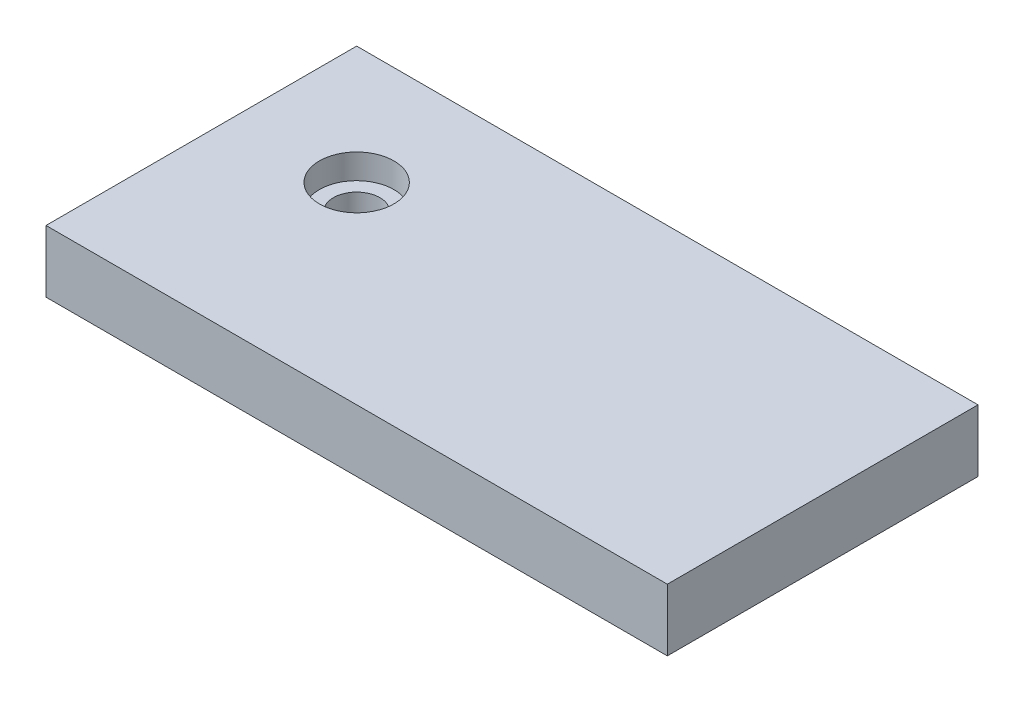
ISO-10303-21;
HEADER;
FILE_DESCRIPTION(('STEP AP214'),'2;1');
FILE_NAME('part.step','',(''),(''),'','','');
FILE_SCHEMA(('AUTOMOTIVE_DESIGN { 1 0 10303 214 1 1 1 1 }'));
ENDSEC;
DATA;
#1=APPLICATION_CONTEXT('core data for automotive mechanical design processes');
#2=APPLICATION_PROTOCOL_DEFINITION('international standard','automotive_design',2000,#1);
#3=PRODUCT_CONTEXT('',#1,'mechanical');
#4=PRODUCT('Part','Part','',(#3));
#5=PRODUCT_RELATED_PRODUCT_CATEGORY('part','',(#4));
#6=PRODUCT_DEFINITION_FORMATION('','',#4);
#7=PRODUCT_DEFINITION_CONTEXT('part definition',#1,'design');
#8=PRODUCT_DEFINITION('design','',#6,#7);
#9=PRODUCT_DEFINITION_SHAPE('','',#8);
#10=(LENGTH_UNIT() NAMED_UNIT(*) SI_UNIT(.MILLI.,.METRE.));
#11=(NAMED_UNIT(*) PLANE_ANGLE_UNIT() SI_UNIT($,.RADIAN.));
#12=(NAMED_UNIT(*) SI_UNIT($,.STERADIAN.) SOLID_ANGLE_UNIT());
#13=UNCERTAINTY_MEASURE_WITH_UNIT(LENGTH_MEASURE(1.E-05),#10,'distance_accuracy_value','');
#14=(GEOMETRIC_REPRESENTATION_CONTEXT(3) GLOBAL_UNCERTAINTY_ASSIGNED_CONTEXT((#13)) GLOBAL_UNIT_ASSIGNED_CONTEXT((#10,
#11,#12)) REPRESENTATION_CONTEXT('',''));
#15=CARTESIAN_POINT('',(0.,0.,0.));
#16=DIRECTION('',(0.,0.,1.));
#17=DIRECTION('',(1.,0.,0.));
#18=AXIS2_PLACEMENT_3D('',#15,#16,#17);
#19=CARTESIAN_POINT('',(0.,10.,0.));
#20=DIRECTION('',(1.,0.,0.));
#21=DIRECTION('',(0.,0.,-1.));
#22=AXIS2_PLACEMENT_3D('',#19,#20,#21);
#23=PLANE('',#22);
#24=DIRECTION('',(0.,0.,1.));
#25=VECTOR('',#24,1.);
#26=CARTESIAN_POINT('',(0.,0.,0.));
#27=LINE('',#26,#25);
#28=CARTESIAN_POINT('',(0.,0.,-50.));
#29=VERTEX_POINT('',#28);
#30=CARTESIAN_POINT('',(0.,0.,0.));
#31=VERTEX_POINT('',#30);
#32=EDGE_CURVE('E95',#29,#31,#27,.T.);
#33=ORIENTED_EDGE('',*,*,#32,.T.);
#34=DIRECTION('',(0.,-1.,0.));
#35=VECTOR('',#34,1.);
#36=CARTESIAN_POINT('',(0.,10.,0.));
#37=LINE('',#36,#35);
#38=CARTESIAN_POINT('',(0.,10.,0.));
#39=VERTEX_POINT('',#38);
#40=EDGE_CURVE('E11',#39,#31,#37,.T.);
#41=ORIENTED_EDGE('',*,*,#40,.F.);
#42=DIRECTION('',(0.,0.,1.));
#43=VECTOR('',#42,1.);
#44=CARTESIAN_POINT('',(0.,10.,0.));
#45=LINE('',#44,#43);
#46=CARTESIAN_POINT('',(0.,10.,-50.));
#47=VERTEX_POINT('',#46);
#48=EDGE_CURVE('E83',#47,#39,#45,.T.);
#49=ORIENTED_EDGE('',*,*,#48,.F.);
#50=DIRECTION('',(0.,-1.,0.));
#51=VECTOR('',#50,1.);
#52=CARTESIAN_POINT('',(0.,10.,-50.));
#53=LINE('',#52,#51);
#54=EDGE_CURVE('E91',#47,#29,#53,.T.);
#55=ORIENTED_EDGE('',*,*,#54,.T.);
#56=EDGE_LOOP('',(#33,#41,#49,#55));
#57=FACE_BOUND('',#56,.T.);
#58=ADVANCED_FACE('F32',(#57),#23,.F.);
#59=CARTESIAN_POINT('',(0.,10.,0.));
#60=DIRECTION('',(0.,0.,-1.));
#61=DIRECTION('',(-1.,0.,0.));
#62=AXIS2_PLACEMENT_3D('',#59,#60,#61);
#63=PLANE('',#62);
#64=DIRECTION('',(1.,0.,0.));
#65=VECTOR('',#64,1.);
#66=CARTESIAN_POINT('',(0.,0.,0.));
#67=LINE('',#66,#65);
#68=CARTESIAN_POINT('',(100.,0.,0.));
#69=VERTEX_POINT('',#68);
#70=EDGE_CURVE('E87',#31,#69,#67,.T.);
#71=ORIENTED_EDGE('',*,*,#70,.T.);
#72=DIRECTION('',(0.,-1.,0.));
#73=VECTOR('',#72,1.);
#74=CARTESIAN_POINT('',(100.,10.,0.));
#75=LINE('',#74,#73);
#76=CARTESIAN_POINT('',(100.,10.,0.));
#77=VERTEX_POINT('',#76);
#78=EDGE_CURVE('E40',#77,#69,#75,.T.);
#79=ORIENTED_EDGE('',*,*,#78,.F.);
#80=DIRECTION('',(1.,0.,0.));
#81=VECTOR('',#80,1.);
#82=CARTESIAN_POINT('',(0.,10.,0.));
#83=LINE('',#82,#81);
#84=EDGE_CURVE('E78',#39,#77,#83,.T.);
#85=ORIENTED_EDGE('',*,*,#84,.F.);
#86=ORIENTED_EDGE('',*,*,#40,.T.);
#87=EDGE_LOOP('',(#71,#79,#85,#86));
#88=FACE_BOUND('',#87,.T.);
#89=ADVANCED_FACE('F86',(#88),#63,.F.);
#90=CARTESIAN_POINT('',(100.,10.,0.));
#91=DIRECTION('',(-1.,0.,0.));
#92=DIRECTION('',(0.,0.,1.));
#93=AXIS2_PLACEMENT_3D('',#90,#91,#92);
#94=PLANE('',#93);
#95=DIRECTION('',(0.,0.,-1.));
#96=VECTOR('',#95,1.);
#97=CARTESIAN_POINT('',(100.,0.,0.));
#98=LINE('',#97,#96);
#99=CARTESIAN_POINT('',(100.,0.,-50.));
#100=VERTEX_POINT('',#99);
#101=EDGE_CURVE('E65',#69,#100,#98,.T.);
#102=ORIENTED_EDGE('',*,*,#101,.T.);
#103=DIRECTION('',(0.,-1.,0.));
#104=VECTOR('',#103,1.);
#105=CARTESIAN_POINT('',(100.,10.,-50.));
#106=LINE('',#105,#104);
#107=CARTESIAN_POINT('',(100.,10.,-50.));
#108=VERTEX_POINT('',#107);
#109=EDGE_CURVE('E88',#108,#100,#106,.T.);
#110=ORIENTED_EDGE('',*,*,#109,.F.);
#111=DIRECTION('',(0.,0.,-1.));
#112=VECTOR('',#111,1.);
#113=CARTESIAN_POINT('',(100.,10.,0.));
#114=LINE('',#113,#112);
#115=EDGE_CURVE('E81',#77,#108,#114,.T.);
#116=ORIENTED_EDGE('',*,*,#115,.F.);
#117=ORIENTED_EDGE('',*,*,#78,.T.);
#118=EDGE_LOOP('',(#102,#110,#116,#117));
#119=FACE_BOUND('',#118,.T.);
#120=ADVANCED_FACE('F89',(#119),#94,.F.);
#121=CARTESIAN_POINT('',(0.,10.,-50.));
#122=DIRECTION('',(0.,0.,1.));
#123=DIRECTION('',(1.,0.,0.));
#124=AXIS2_PLACEMENT_3D('',#121,#122,#123);
#125=PLANE('',#124);
#126=DIRECTION('',(-1.,0.,0.));
#127=VECTOR('',#126,1.);
#128=CARTESIAN_POINT('',(0.,0.,-50.));
#129=LINE('',#128,#127);
#130=EDGE_CURVE('E71',#100,#29,#129,.T.);
#131=ORIENTED_EDGE('',*,*,#130,.T.);
#132=ORIENTED_EDGE('',*,*,#54,.F.);
#133=DIRECTION('',(-1.,0.,0.));
#134=VECTOR('',#133,1.);
#135=CARTESIAN_POINT('',(0.,10.,-50.));
#136=LINE('',#135,#134);
#137=EDGE_CURVE('E48',#108,#47,#136,.T.);
#138=ORIENTED_EDGE('',*,*,#137,.F.);
#139=ORIENTED_EDGE('',*,*,#109,.T.);
#140=EDGE_LOOP('',(#131,#132,#138,#139));
#141=FACE_BOUND('',#140,.T.);
#142=ADVANCED_FACE('F103',(#141),#125,.F.);
#143=CARTESIAN_POINT('',(0.,10.,-50.));
#144=DIRECTION('',(0.,-1.,0.));
#145=DIRECTION('',(0.,0.,-1.));
#146=AXIS2_PLACEMENT_3D('',#143,#144,#145);
#147=PLANE('',#146);
#148=CARTESIAN_POINT('',(19.,10.,-31.));
#149=DIRECTION('',(0.,1.,0.));
#150=DIRECTION('',(0.,0.,1.));
#151=AXIS2_PLACEMENT_3D('',#148,#149,#150);
#152=CIRCLE('',#151,6.);
#153=CARTESIAN_POINT('',(19.,10.,-25.));
#154=VERTEX_POINT('',#153);
#155=EDGE_CURVE('E117',#154,#154,#152,.T.);
#156=ORIENTED_EDGE('',*,*,#155,.F.);
#157=EDGE_LOOP('',(#156));
#158=FACE_BOUND('',#157,.T.);
#159=ORIENTED_EDGE('',*,*,#48,.T.);
#160=ORIENTED_EDGE('',*,*,#84,.T.);
#161=ORIENTED_EDGE('',*,*,#115,.T.);
#162=ORIENTED_EDGE('',*,*,#137,.T.);
#163=EDGE_LOOP('',(#159,#160,#161,#162));
#164=FACE_BOUND('',#163,.T.);
#165=ADVANCED_FACE('F79',(#158,#164),#147,.F.);
#166=CARTESIAN_POINT('',(0.,0.,-50.));
#167=DIRECTION('',(0.,-1.,0.));
#168=DIRECTION('',(0.,0.,-1.));
#169=AXIS2_PLACEMENT_3D('',#166,#167,#168);
#170=PLANE('',#169);
#171=CARTESIAN_POINT('',(19.,0.,-31.));
#172=DIRECTION('',(0.,1.,0.));
#173=DIRECTION('',(0.,0.,1.));
#174=AXIS2_PLACEMENT_3D('',#171,#172,#173);
#175=CIRCLE('',#174,3.75);
#176=CARTESIAN_POINT('',(19.,0.,-27.25));
#177=VERTEX_POINT('',#176);
#178=EDGE_CURVE('E98',#177,#177,#175,.T.);
#179=ORIENTED_EDGE('',*,*,#178,.T.);
#180=EDGE_LOOP('',(#179));
#181=FACE_BOUND('',#180,.T.);
#182=ORIENTED_EDGE('',*,*,#32,.F.);
#183=ORIENTED_EDGE('',*,*,#130,.F.);
#184=ORIENTED_EDGE('',*,*,#101,.F.);
#185=ORIENTED_EDGE('',*,*,#70,.F.);
#186=EDGE_LOOP('',(#182,#183,#184,#185));
#187=FACE_BOUND('',#186,.T.);
#188=ADVANCED_FACE('F106',(#181,#187),#170,.T.);
#189=CARTESIAN_POINT('',(19.,10.,-31.));
#190=DIRECTION('',(0.,1.,0.));
#191=DIRECTION('',(0.,0.,1.));
#192=AXIS2_PLACEMENT_3D('',#189,#190,#191);
#193=CYLINDRICAL_SURFACE('',#192,3.75);
#194=ORIENTED_EDGE('',*,*,#178,.F.);
#195=EDGE_LOOP('',(#194));
#196=FACE_BOUND('',#195,.T.);
#197=CARTESIAN_POINT('',(19.,6.,-31.));
#198=DIRECTION('',(0.,1.,0.));
#199=DIRECTION('',(0.,0.,1.));
#200=AXIS2_PLACEMENT_3D('',#197,#198,#199);
#201=CIRCLE('',#200,3.75);
#202=CARTESIAN_POINT('',(19.,6.,-27.25));
#203=VERTEX_POINT('',#202);
#204=EDGE_CURVE('E111',#203,#203,#201,.T.);
#205=ORIENTED_EDGE('',*,*,#204,.T.);
#206=EDGE_LOOP('',(#205));
#207=FACE_BOUND('',#206,.T.);
#208=ADVANCED_FACE('F129',(#196,#207),#193,.F.);
#209=CARTESIAN_POINT('',(22.75,6.,-31.));
#210=DIRECTION('',(0.,-1.,0.));
#211=DIRECTION('',(0.,0.,-1.));
#212=AXIS2_PLACEMENT_3D('',#209,#210,#211);
#213=PLANE('',#212);
#214=ORIENTED_EDGE('',*,*,#204,.F.);
#215=EDGE_LOOP('',(#214));
#216=FACE_BOUND('',#215,.T.);
#217=CARTESIAN_POINT('',(19.,6.,-31.));
#218=DIRECTION('',(0.,1.,0.));
#219=DIRECTION('',(0.,0.,1.));
#220=AXIS2_PLACEMENT_3D('',#217,#218,#219);
#221=CIRCLE('',#220,6.);
#222=CARTESIAN_POINT('',(19.,6.,-25.));
#223=VERTEX_POINT('',#222);
#224=EDGE_CURVE('E114',#223,#223,#221,.T.);
#225=ORIENTED_EDGE('',*,*,#224,.T.);
#226=EDGE_LOOP('',(#225));
#227=FACE_BOUND('',#226,.T.);
#228=ADVANCED_FACE('F167',(#216,#227),#213,.F.);
#229=CARTESIAN_POINT('',(19.,10.,-31.));
#230=DIRECTION('',(0.,1.,0.));
#231=DIRECTION('',(0.,0.,1.));
#232=AXIS2_PLACEMENT_3D('',#229,#230,#231);
#233=CYLINDRICAL_SURFACE('',#232,6.);
#234=ORIENTED_EDGE('',*,*,#224,.F.);
#235=EDGE_LOOP('',(#234));
#236=FACE_BOUND('',#235,.T.);
#237=ORIENTED_EDGE('',*,*,#155,.T.);
#238=EDGE_LOOP('',(#237));
#239=FACE_BOUND('',#238,.T.);
#240=ADVANCED_FACE('F121',(#236,#239),#233,.F.);
#241=CLOSED_SHELL('',(#58,#89,#120,#142,#165,#188,#208,#228,#240));
#242=MANIFOLD_SOLID_BREP('B2',#241);
#243=ADVANCED_BREP_SHAPE_REPRESENTATION('',(#18,#242),#14);
#244=SHAPE_DEFINITION_REPRESENTATION(#9,#243);
ENDSEC;
END-ISO-10303-21;
